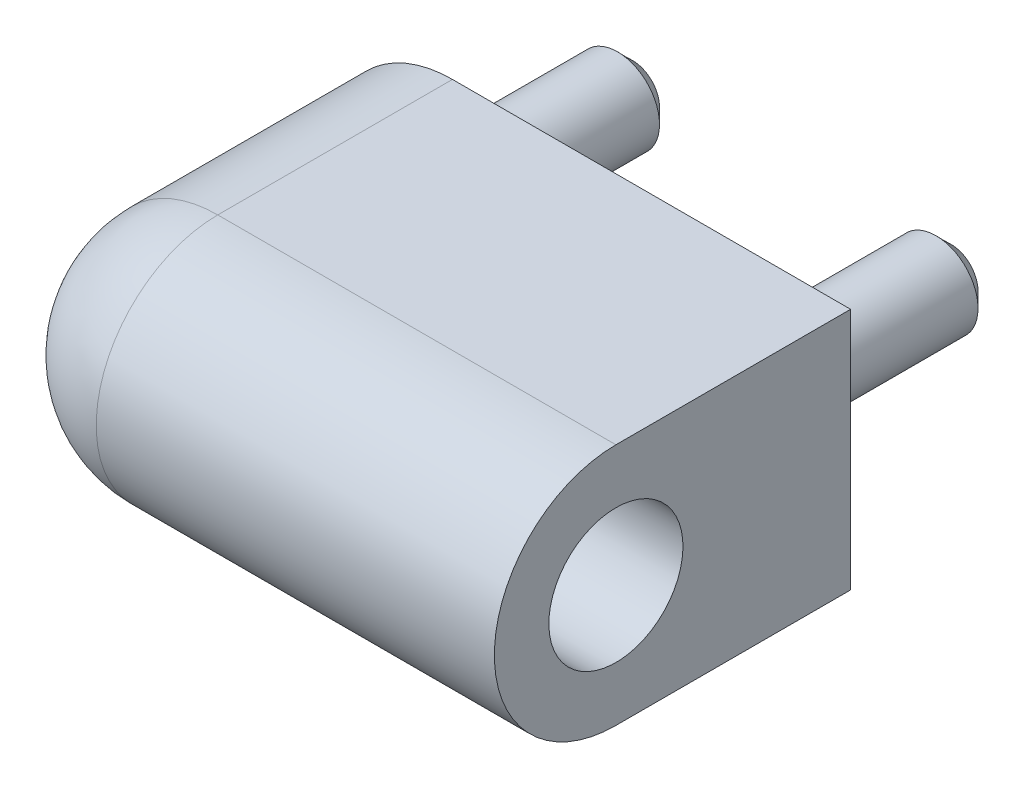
ISO-10303-21;
HEADER;
FILE_DESCRIPTION(('STEP AP214'),'2;1');
FILE_NAME('part.step','',(''),(''),'','','');
FILE_SCHEMA(('AUTOMOTIVE_DESIGN { 1 0 10303 214 1 1 1 1 }'));
ENDSEC;
DATA;
#1=APPLICATION_CONTEXT('core data for automotive mechanical design processes');
#2=APPLICATION_PROTOCOL_DEFINITION('international standard','automotive_design',2000,#1);
#3=PRODUCT_CONTEXT('',#1,'mechanical');
#4=PRODUCT('Part','Part','',(#3));
#5=PRODUCT_RELATED_PRODUCT_CATEGORY('part','',(#4));
#6=PRODUCT_DEFINITION_FORMATION('','',#4);
#7=PRODUCT_DEFINITION_CONTEXT('part definition',#1,'design');
#8=PRODUCT_DEFINITION('design','',#6,#7);
#9=PRODUCT_DEFINITION_SHAPE('','',#8);
#10=(LENGTH_UNIT() NAMED_UNIT(*) SI_UNIT(.MILLI.,.METRE.));
#11=(NAMED_UNIT(*) PLANE_ANGLE_UNIT() SI_UNIT($,.RADIAN.));
#12=(NAMED_UNIT(*) SI_UNIT($,.STERADIAN.) SOLID_ANGLE_UNIT());
#13=UNCERTAINTY_MEASURE_WITH_UNIT(LENGTH_MEASURE(1.E-05),#10,'distance_accuracy_value','');
#14=(GEOMETRIC_REPRESENTATION_CONTEXT(3) GLOBAL_UNCERTAINTY_ASSIGNED_CONTEXT((#13)) GLOBAL_UNIT_ASSIGNED_CONTEXT((#10,
#11,#12)) REPRESENTATION_CONTEXT('',''));
#15=CARTESIAN_POINT('',(0.,0.,0.));
#16=DIRECTION('',(0.,0.,1.));
#17=DIRECTION('',(1.,0.,0.));
#18=AXIS2_PLACEMENT_3D('',#15,#16,#17);
#19=CARTESIAN_POINT('',(-6.,7.25,0.));
#20=DIRECTION('',(0.,0.,1.));
#21=DIRECTION('',(-1.,0.,0.));
#22=AXIS2_PLACEMENT_3D('',#19,#20,#21);
#23=PLANE('',#22);
#24=CARTESIAN_POINT('',(19.,0.,0.));
#25=DIRECTION('',(0.,0.,1.));
#26=DIRECTION('',(-1.,0.,0.));
#27=AXIS2_PLACEMENT_3D('',#24,#25,#26);
#28=CIRCLE('',#27,2.5);
#29=CARTESIAN_POINT('',(16.5,0.,0.));
#30=VERTEX_POINT('',#29);
#31=EDGE_CURVE('E113',#30,#30,#28,.F.);
#32=ORIENTED_EDGE('',*,*,#31,.F.);
#33=EDGE_LOOP('',(#32));
#34=FACE_BOUND('',#33,.T.);
#35=CARTESIAN_POINT('',(1.25,0.,0.));
#36=DIRECTION('',(0.,0.,1.));
#37=DIRECTION('',(-1.,0.,0.));
#38=AXIS2_PLACEMENT_3D('',#35,#36,#37);
#39=CIRCLE('',#38,7.25);
#40=CARTESIAN_POINT('',(1.25,-7.25,0.));
#41=VERTEX_POINT('',#40);
#42=CARTESIAN_POINT('',(-6.,0.,0.));
#43=VERTEX_POINT('',#42);
#44=EDGE_CURVE('E34',#41,#43,#39,.F.);
#45=ORIENTED_EDGE('',*,*,#44,.T.);
#46=CARTESIAN_POINT('',(1.25,0.,0.));
#47=DIRECTION('',(0.,0.,1.));
#48=DIRECTION('',(-1.,0.,0.));
#49=AXIS2_PLACEMENT_3D('',#46,#47,#48);
#50=CIRCLE('',#49,7.25);
#51=CARTESIAN_POINT('',(1.25,7.25,0.));
#52=VERTEX_POINT('',#51);
#53=EDGE_CURVE('E29',#43,#52,#50,.F.);
#54=ORIENTED_EDGE('',*,*,#53,.T.);
#55=DIRECTION('',(1.,0.,0.));
#56=VECTOR('',#55,1.);
#57=CARTESIAN_POINT('',(-6.,7.25,0.));
#58=LINE('',#57,#56);
#59=CARTESIAN_POINT('',(25.,7.25,0.));
#60=VERTEX_POINT('',#59);
#61=EDGE_CURVE('E102',#52,#60,#58,.T.);
#62=ORIENTED_EDGE('',*,*,#61,.T.);
#63=DIRECTION('',(0.,-1.,0.));
#64=VECTOR('',#63,1.);
#65=CARTESIAN_POINT('',(25.,7.25,0.));
#66=LINE('',#65,#64);
#67=CARTESIAN_POINT('',(25.,-7.25,0.));
#68=VERTEX_POINT('',#67);
#69=EDGE_CURVE('E87',#60,#68,#66,.T.);
#70=ORIENTED_EDGE('',*,*,#69,.T.);
#71=DIRECTION('',(1.,0.,0.));
#72=VECTOR('',#71,1.);
#73=CARTESIAN_POINT('',(-6.,-7.25,0.));
#74=LINE('',#73,#72);
#75=EDGE_CURVE('E100',#41,#68,#74,.T.);
#76=ORIENTED_EDGE('',*,*,#75,.F.);
#77=EDGE_LOOP('',(#45,#54,#62,#70,#76));
#78=FACE_BOUND('',#77,.T.);
#79=CARTESIAN_POINT('',(0.,0.,0.));
#80=DIRECTION('',(0.,0.,1.));
#81=DIRECTION('',(-1.,0.,0.));
#82=AXIS2_PLACEMENT_3D('',#79,#80,#81);
#83=CIRCLE('',#82,2.5);
#84=CARTESIAN_POINT('',(-2.5,0.,0.));
#85=VERTEX_POINT('',#84);
#86=EDGE_CURVE('E116',#85,#85,#83,.F.);
#87=ORIENTED_EDGE('',*,*,#86,.F.);
#88=EDGE_LOOP('',(#87));
#89=FACE_BOUND('',#88,.T.);
#90=ADVANCED_FACE('F14',(#34,#78,#89),#23,.F.);
#91=CARTESIAN_POINT('',(-6.,7.25,0.));
#92=DIRECTION('',(0.,-1.,0.));
#93=DIRECTION('',(1.,0.,0.));
#94=AXIS2_PLACEMENT_3D('',#91,#92,#93);
#95=PLANE('',#94);
#96=ORIENTED_EDGE('',*,*,#61,.F.);
#97=DIRECTION('',(0.,0.,-1.));
#98=VECTOR('',#97,1.);
#99=CARTESIAN_POINT('',(1.25,7.25,14.));
#100=LINE('',#99,#98);
#101=CARTESIAN_POINT('',(1.25,7.25,14.));
#102=VERTEX_POINT('',#101);
#103=EDGE_CURVE('E109',#52,#102,#100,.F.);
#104=ORIENTED_EDGE('',*,*,#103,.T.);
#105=DIRECTION('',(1.,0.,0.));
#106=VECTOR('',#105,1.);
#107=CARTESIAN_POINT('',(-6.,7.25,14.));
#108=LINE('',#107,#106);
#109=CARTESIAN_POINT('',(25.,7.25,14.));
#110=VERTEX_POINT('',#109);
#111=EDGE_CURVE('E96',#102,#110,#108,.T.);
#112=ORIENTED_EDGE('',*,*,#111,.T.);
#113=DIRECTION('',(0.,0.,-1.));
#114=VECTOR('',#113,1.);
#115=CARTESIAN_POINT('',(25.,7.25,0.));
#116=LINE('',#115,#114);
#117=EDGE_CURVE('E84',#110,#60,#116,.T.);
#118=ORIENTED_EDGE('',*,*,#117,.T.);
#119=EDGE_LOOP('',(#96,#104,#112,#118));
#120=FACE_BOUND('',#119,.T.);
#121=ADVANCED_FACE('F140',(#120),#95,.F.);
#122=CARTESIAN_POINT('',(-6.,-7.25,0.));
#123=DIRECTION('',(0.,1.,0.));
#124=DIRECTION('',(-1.,0.,0.));
#125=AXIS2_PLACEMENT_3D('',#122,#123,#124);
#126=PLANE('',#125);
#127=DIRECTION('',(1.,0.,0.));
#128=VECTOR('',#127,1.);
#129=CARTESIAN_POINT('',(-6.,-7.25,14.));
#130=LINE('',#129,#128);
#131=CARTESIAN_POINT('',(1.25,-7.25,14.));
#132=VERTEX_POINT('',#131);
#133=CARTESIAN_POINT('',(25.,-7.25,14.));
#134=VERTEX_POINT('',#133);
#135=EDGE_CURVE('E98',#132,#134,#130,.T.);
#136=ORIENTED_EDGE('',*,*,#135,.F.);
#137=DIRECTION('',(0.,0.,1.));
#138=VECTOR('',#137,1.);
#139=CARTESIAN_POINT('',(1.25,-7.25,0.));
#140=LINE('',#139,#138);
#141=EDGE_CURVE('E111',#132,#41,#140,.F.);
#142=ORIENTED_EDGE('',*,*,#141,.T.);
#143=ORIENTED_EDGE('',*,*,#75,.T.);
#144=DIRECTION('',(0.,0.,1.));
#145=VECTOR('',#144,1.);
#146=CARTESIAN_POINT('',(25.,-7.25,0.));
#147=LINE('',#146,#145);
#148=EDGE_CURVE('E90',#68,#134,#147,.T.);
#149=ORIENTED_EDGE('',*,*,#148,.T.);
#150=EDGE_LOOP('',(#136,#142,#143,#149));
#151=FACE_BOUND('',#150,.T.);
#152=ADVANCED_FACE('F147',(#151),#126,.F.);
#153=CARTESIAN_POINT('',(-6.,0.,14.));
#154=DIRECTION('',(1.,0.,0.));
#155=DIRECTION('',(0.,1.,0.));
#156=AXIS2_PLACEMENT_3D('',#153,#154,#155);
#157=CYLINDRICAL_SURFACE('',#156,7.25);
#158=ORIENTED_EDGE('',*,*,#111,.F.);
#159=CARTESIAN_POINT('',(1.25,0.,14.));
#160=DIRECTION('',(1.,0.,0.));
#161=DIRECTION('',(0.,1.,0.));
#162=AXIS2_PLACEMENT_3D('',#159,#160,#161);
#163=CIRCLE('',#162,7.25);
#164=EDGE_CURVE('E104',#102,#132,#163,.T.);
#165=ORIENTED_EDGE('',*,*,#164,.T.);
#166=ORIENTED_EDGE('',*,*,#135,.T.);
#167=CARTESIAN_POINT('',(25.,0.,14.));
#168=DIRECTION('',(-1.,0.,0.));
#169=DIRECTION('',(0.,-1.,0.));
#170=AXIS2_PLACEMENT_3D('',#167,#168,#169);
#171=CIRCLE('',#170,7.25);
#172=EDGE_CURVE('E93',#134,#110,#171,.T.);
#173=ORIENTED_EDGE('',*,*,#172,.T.);
#174=EDGE_LOOP('',(#158,#165,#166,#173));
#175=FACE_BOUND('',#174,.T.);
#176=ADVANCED_FACE('F154',(#175),#157,.T.);
#177=CARTESIAN_POINT('',(25.,0.,14.));
#178=DIRECTION('',(-1.,0.,0.));
#179=DIRECTION('',(0.,-1.,0.));
#180=AXIS2_PLACEMENT_3D('',#177,#178,#179);
#181=PLANE('',#180);
#182=CARTESIAN_POINT('',(25.,0.,14.));
#183=DIRECTION('',(1.,0.,0.));
#184=DIRECTION('',(0.,1.,0.));
#185=AXIS2_PLACEMENT_3D('',#182,#183,#184);
#186=CIRCLE('',#185,4.);
#187=CARTESIAN_POINT('',(25.,4.,14.));
#188=VERTEX_POINT('',#187);
#189=EDGE_CURVE('E72',#188,#188,#186,.T.);
#190=ORIENTED_EDGE('',*,*,#189,.F.);
#191=EDGE_LOOP('',(#190));
#192=FACE_BOUND('',#191,.T.);
#193=ORIENTED_EDGE('',*,*,#117,.F.);
#194=ORIENTED_EDGE('',*,*,#172,.F.);
#195=ORIENTED_EDGE('',*,*,#148,.F.);
#196=ORIENTED_EDGE('',*,*,#69,.F.);
#197=EDGE_LOOP('',(#193,#194,#195,#196));
#198=FACE_BOUND('',#197,.T.);
#199=ADVANCED_FACE('F158',(#192,#198),#181,.F.);
#200=CARTESIAN_POINT('',(1.25,0.,14.));
#201=DIRECTION('',(0.,0.,-1.));
#202=DIRECTION('',(1.,0.,0.));
#203=AXIS2_PLACEMENT_3D('',#200,#201,#202);
#204=CYLINDRICAL_SURFACE('',#203,7.25);
#205=DIRECTION('',(0.,0.,1.));
#206=VECTOR('',#205,1.);
#207=CARTESIAN_POINT('',(-6.,0.,14.));
#208=LINE('',#207,#206);
#209=CARTESIAN_POINT('',(-6.,0.,14.));
#210=VERTEX_POINT('',#209);
#211=EDGE_CURVE('E82',#43,#210,#208,.T.);
#212=ORIENTED_EDGE('',*,*,#211,.F.);
#213=ORIENTED_EDGE('',*,*,#44,.F.);
#214=ORIENTED_EDGE('',*,*,#141,.F.);
#215=CARTESIAN_POINT('',(1.25,0.,14.));
#216=DIRECTION('',(0.,0.,1.));
#217=DIRECTION('',(-1.,0.,0.));
#218=AXIS2_PLACEMENT_3D('',#215,#216,#217);
#219=CIRCLE('',#218,7.25);
#220=EDGE_CURVE('E80',#210,#132,#219,.T.);
#221=ORIENTED_EDGE('',*,*,#220,.F.);
#222=EDGE_LOOP('',(#212,#213,#214,#221));
#223=FACE_BOUND('',#222,.T.);
#224=ADVANCED_FACE('F162',(#223),#204,.T.);
#225=CARTESIAN_POINT('',(1.25,0.,14.));
#226=DIRECTION('',(0.,0.,1.));
#227=DIRECTION('',(-1.,0.,0.));
#228=AXIS2_PLACEMENT_3D('',#225,#226,#227);
#229=CYLINDRICAL_SURFACE('',#228,7.25);
#230=ORIENTED_EDGE('',*,*,#53,.F.);
#231=ORIENTED_EDGE('',*,*,#211,.T.);
#232=CARTESIAN_POINT('',(1.25,0.,14.));
#233=DIRECTION('',(0.,0.,1.));
#234=DIRECTION('',(-1.,0.,0.));
#235=AXIS2_PLACEMENT_3D('',#232,#233,#234);
#236=CIRCLE('',#235,7.25);
#237=EDGE_CURVE('E75',#102,#210,#236,.T.);
#238=ORIENTED_EDGE('',*,*,#237,.F.);
#239=ORIENTED_EDGE('',*,*,#103,.F.);
#240=EDGE_LOOP('',(#230,#231,#238,#239));
#241=FACE_BOUND('',#240,.T.);
#242=ADVANCED_FACE('F166',(#241),#229,.T.);
#243=CARTESIAN_POINT('',(1.25,0.,14.));
#244=DIRECTION('',(-1.,0.,0.));
#245=DIRECTION('',(0.,-1.,0.));
#246=AXIS2_PLACEMENT_3D('',#243,#244,#245);
#247=SPHERICAL_SURFACE('',#246,7.25);
#248=ORIENTED_EDGE('',*,*,#220,.T.);
#249=ORIENTED_EDGE('',*,*,#164,.F.);
#250=ORIENTED_EDGE('',*,*,#237,.T.);
#251=EDGE_LOOP('',(#248,#249,#250));
#252=FACE_BOUND('',#251,.T.);
#253=ADVANCED_FACE('F170',(#252),#247,.T.);
#254=CARTESIAN_POINT('',(25.,0.,14.));
#255=DIRECTION('',(1.,0.,0.));
#256=DIRECTION('',(0.,1.,0.));
#257=AXIS2_PLACEMENT_3D('',#254,#255,#256);
#258=CYLINDRICAL_SURFACE('',#257,4.);
#259=CARTESIAN_POINT('',(0.,0.,14.));
#260=DIRECTION('',(1.,0.,0.));
#261=DIRECTION('',(0.,1.,0.));
#262=AXIS2_PLACEMENT_3D('',#259,#260,#261);
#263=CIRCLE('',#262,4.);
#264=CARTESIAN_POINT('',(0.,4.,14.));
#265=VERTEX_POINT('',#264);
#266=EDGE_CURVE('E70',#265,#265,#263,.T.);
#267=ORIENTED_EDGE('',*,*,#266,.F.);
#268=EDGE_LOOP('',(#267));
#269=FACE_BOUND('',#268,.T.);
#270=ORIENTED_EDGE('',*,*,#189,.T.);
#271=EDGE_LOOP('',(#270));
#272=FACE_BOUND('',#271,.T.);
#273=ADVANCED_FACE('F66',(#269,#272),#258,.F.);
#274=CARTESIAN_POINT('',(0.,0.,14.));
#275=DIRECTION('',(1.,0.,0.));
#276=DIRECTION('',(0.,1.,0.));
#277=AXIS2_PLACEMENT_3D('',#274,#275,#276);
#278=CONICAL_SURFACE('',#277,4.,1.02974425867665);
#279=CARTESIAN_POINT('',(-2.40344247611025,0.,14.));
#280=VERTEX_POINT('',#279);
#281=VERTEX_LOOP('',#280);
#282=FACE_BOUND('',#281,.T.);
#283=ORIENTED_EDGE('',*,*,#266,.T.);
#284=EDGE_LOOP('',(#283));
#285=FACE_BOUND('',#284,.T.);
#286=ADVANCED_FACE('F62',(#282,#285),#278,.F.);
#287=CARTESIAN_POINT('',(19.,0.,-12.));
#288=DIRECTION('',(0.,0.,1.));
#289=DIRECTION('',(-1.,0.,0.));
#290=AXIS2_PLACEMENT_3D('',#287,#288,#289);
#291=CYLINDRICAL_SURFACE('',#290,2.5);
#292=CARTESIAN_POINT('',(19.,0.,-11.1));
#293=DIRECTION('',(0.,0.,-1.));
#294=DIRECTION('',(1.,0.,0.));
#295=AXIS2_PLACEMENT_3D('',#292,#293,#294);
#296=CIRCLE('',#295,2.5);
#297=CARTESIAN_POINT('',(21.5,0.,-11.1));
#298=VERTEX_POINT('',#297);
#299=EDGE_CURVE('E122',#298,#298,#296,.F.);
#300=ORIENTED_EDGE('',*,*,#299,.T.);
#301=EDGE_LOOP('',(#300));
#302=FACE_BOUND('',#301,.T.);
#303=ORIENTED_EDGE('',*,*,#31,.T.);
#304=EDGE_LOOP('',(#303));
#305=FACE_BOUND('',#304,.T.);
#306=ADVANCED_FACE('F65',(#302,#305),#291,.T.);
#307=CARTESIAN_POINT('',(19.,0.,-12.));
#308=DIRECTION('',(0.,0.,-1.));
#309=DIRECTION('',(1.,0.,0.));
#310=AXIS2_PLACEMENT_3D('',#307,#308,#309);
#311=PLANE('',#310);
#312=CARTESIAN_POINT('',(19.,0.,-12.));
#313=DIRECTION('',(0.,0.,-1.));
#314=DIRECTION('',(1.,0.,0.));
#315=AXIS2_PLACEMENT_3D('',#312,#313,#314);
#316=CIRCLE('',#315,1.6);
#317=CARTESIAN_POINT('',(20.6,0.,-12.));
#318=VERTEX_POINT('',#317);
#319=EDGE_CURVE('E119',#318,#318,#316,.T.);
#320=ORIENTED_EDGE('',*,*,#319,.T.);
#321=EDGE_LOOP('',(#320));
#322=FACE_BOUND('',#321,.T.);
#323=ADVANCED_FACE('F179',(#322),#311,.T.);
#324=CARTESIAN_POINT('',(0.,0.,-12.));
#325=DIRECTION('',(0.,0.,1.));
#326=DIRECTION('',(-1.,0.,0.));
#327=AXIS2_PLACEMENT_3D('',#324,#325,#326);
#328=CYLINDRICAL_SURFACE('',#327,2.5);
#329=CARTESIAN_POINT('',(0.,0.,-11.1));
#330=DIRECTION('',(0.,0.,-1.));
#331=DIRECTION('',(1.,0.,0.));
#332=AXIS2_PLACEMENT_3D('',#329,#330,#331);
#333=CIRCLE('',#332,2.5);
#334=CARTESIAN_POINT('',(2.5,0.,-11.1));
#335=VERTEX_POINT('',#334);
#336=EDGE_CURVE('E9',#335,#335,#333,.F.);
#337=ORIENTED_EDGE('',*,*,#336,.T.);
#338=EDGE_LOOP('',(#337));
#339=FACE_BOUND('',#338,.T.);
#340=ORIENTED_EDGE('',*,*,#86,.T.);
#341=EDGE_LOOP('',(#340));
#342=FACE_BOUND('',#341,.T.);
#343=ADVANCED_FACE('F183',(#339,#342),#328,.T.);
#344=CARTESIAN_POINT('',(0.,0.,-12.));
#345=DIRECTION('',(0.,0.,-1.));
#346=DIRECTION('',(1.,0.,0.));
#347=AXIS2_PLACEMENT_3D('',#344,#345,#346);
#348=PLANE('',#347);
#349=CARTESIAN_POINT('',(0.,0.,-12.));
#350=DIRECTION('',(0.,0.,-1.));
#351=DIRECTION('',(1.,0.,0.));
#352=AXIS2_PLACEMENT_3D('',#349,#350,#351);
#353=CIRCLE('',#352,1.6);
#354=CARTESIAN_POINT('',(1.6,0.,-12.));
#355=VERTEX_POINT('',#354);
#356=EDGE_CURVE('E22',#355,#355,#353,.T.);
#357=ORIENTED_EDGE('',*,*,#356,.T.);
#358=EDGE_LOOP('',(#357));
#359=FACE_BOUND('',#358,.T.);
#360=ADVANCED_FACE('F127',(#359),#348,.T.);
#361=CARTESIAN_POINT('',(19.,0.,-12.));
#362=DIRECTION('',(0.,0.,1.));
#363=DIRECTION('',(-1.,0.,0.));
#364=AXIS2_PLACEMENT_3D('',#361,#362,#363);
#365=CONICAL_SURFACE('',#364,1.6,0.785398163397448);
#366=ORIENTED_EDGE('',*,*,#299,.F.);
#367=EDGE_LOOP('',(#366));
#368=FACE_BOUND('',#367,.T.);
#369=ORIENTED_EDGE('',*,*,#319,.F.);
#370=EDGE_LOOP('',(#369));
#371=FACE_BOUND('',#370,.T.);
#372=ADVANCED_FACE('F130',(#368,#371),#365,.T.);
#373=CARTESIAN_POINT('',(0.,0.,-12.));
#374=DIRECTION('',(0.,0.,1.));
#375=DIRECTION('',(-1.,0.,0.));
#376=AXIS2_PLACEMENT_3D('',#373,#374,#375);
#377=CONICAL_SURFACE('',#376,1.6,0.785398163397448);
#378=ORIENTED_EDGE('',*,*,#336,.F.);
#379=EDGE_LOOP('',(#378));
#380=FACE_BOUND('',#379,.T.);
#381=ORIENTED_EDGE('',*,*,#356,.F.);
#382=EDGE_LOOP('',(#381));
#383=FACE_BOUND('',#382,.T.);
#384=ADVANCED_FACE('F16',(#380,#383),#377,.T.);
#385=CLOSED_SHELL('',(#90,#121,#152,#176,#199,#224,#242,#253,#273,#286,#306,#323,#343,#360,#372,#384));
#386=MANIFOLD_SOLID_BREP('B1',#385);
#387=ADVANCED_BREP_SHAPE_REPRESENTATION('',(#18,#386),#14);
#388=SHAPE_DEFINITION_REPRESENTATION(#9,#387);
ENDSEC;
END-ISO-10303-21;
